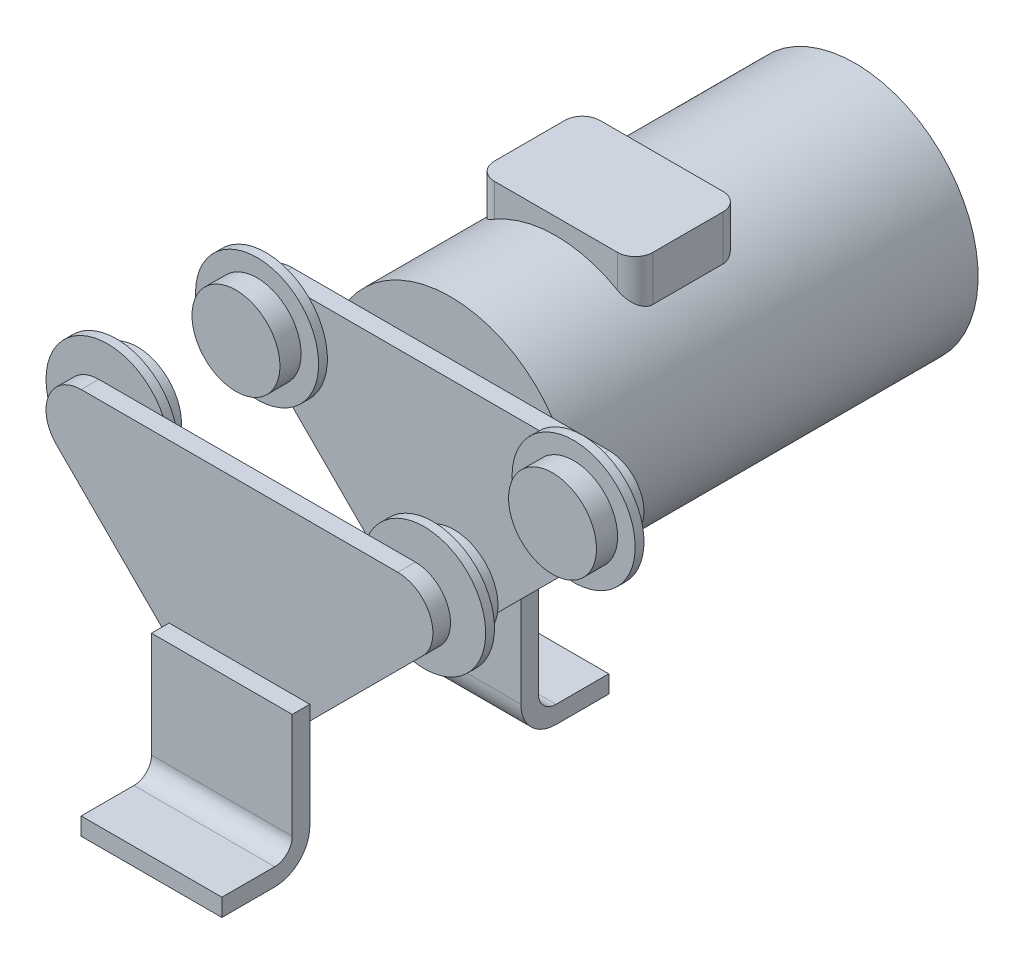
from build123d import *

# Parameters (mm, degrees)
BOSS_EXTRU_1_DEPTH    = 10
ESQUISSE3_R           = 10
BOSS_EXTRU_2_DEPTH    = 5
ESQUISSE4_R           = 35
BOSS_EXTRU_3_DEPTH    = 5
ESQUISSE5_R           = 25
BOSS_EXTRU_4_DEPTH    = 12
ESQUISSE6_R           = 15
BOSS_EXTRU_5_DEPTH    = 100
ESQUISSE7_R           = 70
BOSS_EXTRU_6_DEPTH    = 230
ESQUISSE8_W           = 80
ESQUISSE8_H           = 80
BOSS_EXTRU_7_DEPTH    = 10
ESQUISSE9_W           = 80
ESQUISSE9_H           = 10
BOSS_EXTRU_8_DEPTH    = 40
CONG_1_R              = 10
CONG_2_R              = 20
CONG_1_OF_SYM_TRIE4_R = 10
CONG_2_OF_SYM_TRIE4_R = 20
BOSS_EXTRU_9_DEPTH    = 40


with BuildPart() as part:
    # Esquisse1 → Boss.-Extru.1 (new body)
    with BuildSketch(Plane.XY):
        with BuildLine():
            Line((-90, 0), (90, 0))
            ThreePointArc((90, 0), (108.47759065, -12.346331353), (104.142135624, -34.142135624))
            Line((104.142135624, -34.142135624), (14.142135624, -124.142135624))
            ThreePointArc((14.142135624, -124.142135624), (0, -130), (-14.142135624, -124.142135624))
            Line((-14.142135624, -124.142135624), (-104.142135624, -34.142135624))
            ThreePointArc((-104.142135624, -34.142135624), (-108.47759065, -12.346331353), (-90, 0))
        make_face()
    boss_extru_1 = extrude(amount=BOSS_EXTRU_1_DEPTH)

    # Esquisse3 → Boss.-Extru.2 (add)
    with BuildSketch(Plane(origin=(0, 0, 0), x_dir=(-1, 0, 0), z_dir=(0, 0, -1))):
        with Locations((-90, -20)):
            Circle(ESQUISSE3_R)
        with Locations((90, -20)):
            Circle(ESQUISSE3_R)
    boss_extru_2 = extrude(amount=BOSS_EXTRU_2_DEPTH)

    # Esquisse4 → Boss.-Extru.3 (add)
    with BuildSketch(Plane(origin=(0, 0, -5), x_dir=(-1, 0, 0), z_dir=(0, 0, -1))):
        with Locations((-90, -20)):
            Circle(ESQUISSE4_R)
        with Locations((90, -20)):
            Circle(ESQUISSE4_R)
    boss_extru_3 = extrude(amount=BOSS_EXTRU_3_DEPTH)

    # Esquisse5 → Boss.-Extru.4 (add)
    with BuildSketch(Plane(origin=(0, 0, -10), x_dir=(-1, 0, 0), z_dir=(0, 0, -1))):
        with Locations((-90, -20)):
            Circle(ESQUISSE5_R)
        with Locations((90, -20)):
            Circle(ESQUISSE5_R)
    boss_extru_4 = extrude(amount=BOSS_EXTRU_4_DEPTH)

    # Esquisse6 → Boss.-Extru.5 (add)
    with BuildSketch(Plane(origin=(0, 0, 0), x_dir=(-1, 0, 0), z_dir=(0, 0, -1))):
        with Locations((0, -110)):
            Circle(ESQUISSE6_R)
    extrude(amount=BOSS_EXTRU_5_DEPTH)

    # Sym_trie3: Boss.-Extru.1, Boss.-Extru.2, Boss.-Extru.3, Boss.-Extru.4 across plane
    add(boss_extru_1.mirror(Plane(origin=(0, 0, -50), x_dir=(1, 0, 0), z_dir=(0, 0, -1))))
    add(boss_extru_2.mirror(Plane(origin=(0, 0, -50), x_dir=(1, 0, 0), z_dir=(0, 0, -1))))
    add(boss_extru_3.mirror(Plane(origin=(0, 0, -50), x_dir=(1, 0, 0), z_dir=(0, 0, -1))))
    add(boss_extru_4.mirror(Plane(origin=(0, 0, -50), x_dir=(1, 0, 0), z_dir=(0, 0, -1))))

    # Esquisse7 → Boss.-Extru.6 (add)
    with BuildSketch(Plane(origin=(0, 0, -110), x_dir=(-1, 0, 0), z_dir=(0, 0, -1))):
        with Locations(Location((0, -39.289321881, 0), (0, 0, 145.855910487))):
            Circle(ESQUISSE7_R)
    extrude(amount=BOSS_EXTRU_6_DEPTH)

    # Esquisse8 → Boss.-Extru.7 (add)
    with BuildSketch(Plane.XY.offset(10)):
        with Locations((0, -130)):
            Rectangle(ESQUISSE8_W, ESQUISSE8_H)
    boss_extru_7 = extrude(amount=BOSS_EXTRU_7_DEPTH)

    # Esquisse9 → Boss.-Extru.8 (add)
    with BuildSketch(Plane.XY.offset(20)):
        with Locations((0, -165)):
            Rectangle(ESQUISSE9_W, ESQUISSE9_H)
    boss_extru_8 = extrude(amount=BOSS_EXTRU_8_DEPTH)

    # Cong_1
    cong_1_edges = [part.edges().sort_by_distance(p)[0] for p in [
        (0, -160, 20),
    ]]
    fillet(cong_1_edges, radius=CONG_1_R)

    # Cong_2
    cong_2_edges = [part.edges().sort_by_distance(p)[0] for p in [
        (0, -170, 10),
    ]]
    fillet(cong_2_edges, radius=CONG_2_R)

    # Sym_trie4: Boss.-Extru.7, Boss.-Extru.8 across plane
    add(boss_extru_7.mirror(Plane(origin=(0, 0, -50), x_dir=(1, 0, 0), z_dir=(0, 0, -1))))
    add(boss_extru_8.mirror(Plane(origin=(0, 0, -50), x_dir=(1, 0, 0), z_dir=(0, 0, -1))))

    # Cong_1 of Sym_trie4
    cong_1_of_sym_trie4_edges = [part.edges().sort_by_distance(p)[0] for p in [
        (0, -160, -120),
    ]]
    fillet(cong_1_of_sym_trie4_edges, radius=CONG_1_OF_SYM_TRIE4_R)

    # Cong_2 of Sym_trie4
    cong_2_of_sym_trie4_edges = [part.edges().sort_by_distance(p)[0] for p in [
        (0, -170, -110),
    ]]
    fillet(cong_2_of_sym_trie4_edges, radius=CONG_2_OF_SYM_TRIE4_R)

    # Esquisse10 → Boss.-Extru.9 (add)
    with BuildSketch(Plane(origin=(0, 0, 0), x_dir=(1, 0, 0), z_dir=(0, 1, 0))):
        with BuildLine():
            Line((-35, 230), (35, 230))
            ThreePointArc((35, 230), (42.071067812, 227.071067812), (45, 220))
            Line((45, 220), (45, 180))
            ThreePointArc((45, 180), (42.071067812, 172.928932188), (35, 170))
            Line((35, 170), (-35, 170))
            ThreePointArc((-35, 170), (-42.071067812, 172.928932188), (-45, 180))
            Line((-45, 180), (-45, 220))
            ThreePointArc((-45, 220), (-42.071067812, 227.071067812), (-35, 230))
        make_face()
    extrude(amount=BOSS_EXTRU_9_DEPTH)


solid = part.part
